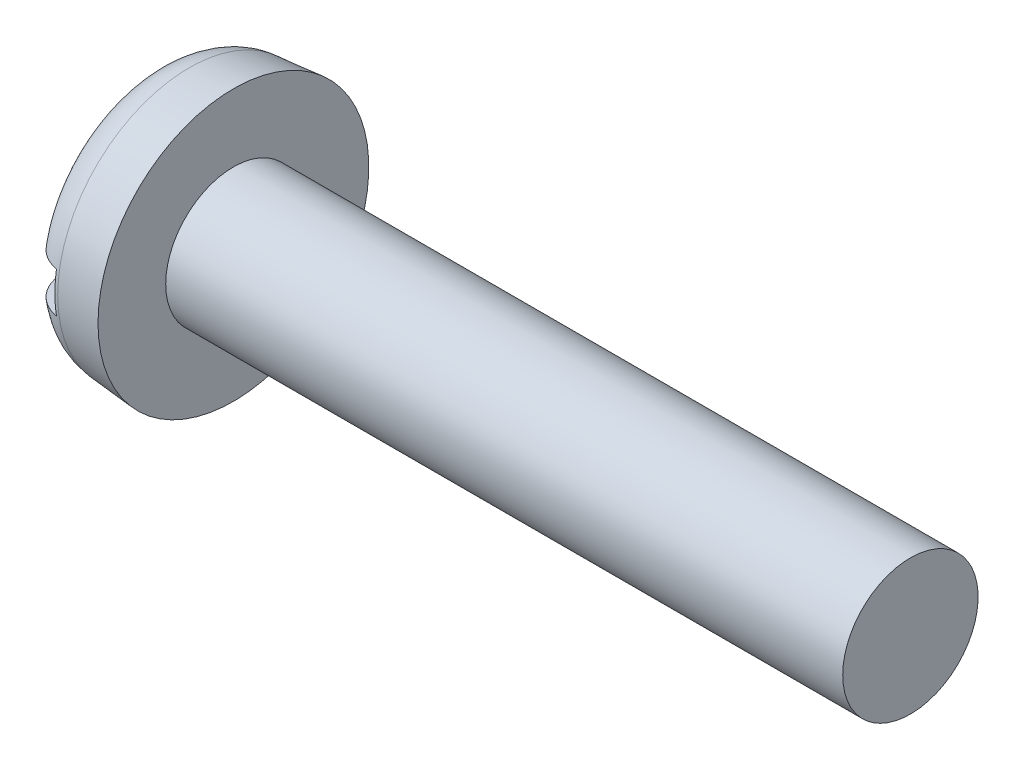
from build123d import *

# Parameters (mm, degrees)
FILLET2_R  = 1.2
SKETCH2_W  = 8
SKETCH2_H  = 1.2
SLOT_DEPTH = 1


with BuildPart() as part:
    # BodySke → Base-Revolve (revolve)
    with BuildSketch(Plane.XY, mode=Mode.PRIVATE) as base_revolve_sk:
        Polygon((2.4, 2), (2.4, 4), (0, 3.790027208), (0, 0), (22.4, 0), (22.4, 2), align=None)
    revolve(base_revolve_sk.sketch.rotate(Axis((-25.4, 0, 0), (1, 0, 0)), 90), axis=Axis((-25.4, 0, 0), (1, 0, 0)))

    # Fillet2
    fillet2_edges = [part.edges().sort_by_distance(p)[0] for p in [
        (0, 0, -3.790027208),
    ]]
    fillet(fillet2_edges, radius=FILLET2_R)

    # Sketch2 → Slot (cut)
    with BuildSketch(Plane(origin=(0, 0, 0), x_dir=(0, 0, -1), z_dir=(1, 0, 0))):
        Rectangle(SKETCH2_W, SKETCH2_H)
    extrude(amount=SLOT_DEPTH, mode=Mode.SUBTRACT)


solid = part.part
